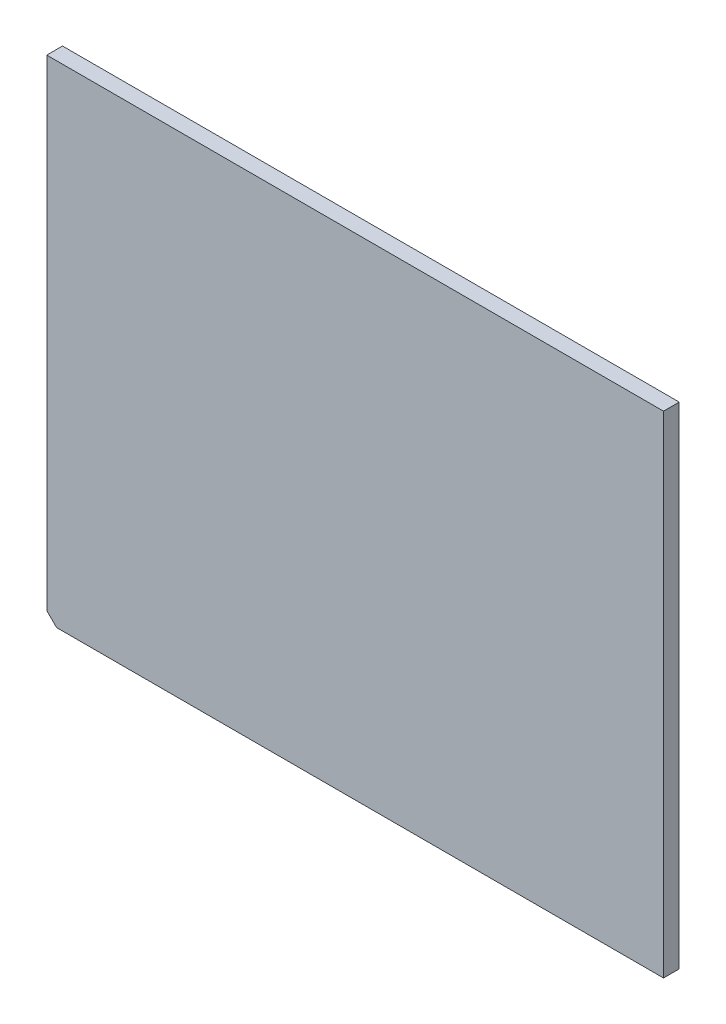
ISO-10303-21;
HEADER;
FILE_DESCRIPTION(('STEP AP214'),'2;1');
FILE_NAME('part.step','',(''),(''),'','','');
FILE_SCHEMA(('AUTOMOTIVE_DESIGN { 1 0 10303 214 1 1 1 1 }'));
ENDSEC;
DATA;
#1=APPLICATION_CONTEXT('core data for automotive mechanical design processes');
#2=APPLICATION_PROTOCOL_DEFINITION('international standard','automotive_design',2000,#1);
#3=PRODUCT_CONTEXT('',#1,'mechanical');
#4=PRODUCT('Part','Part','',(#3));
#5=PRODUCT_RELATED_PRODUCT_CATEGORY('part','',(#4));
#6=PRODUCT_DEFINITION_FORMATION('','',#4);
#7=PRODUCT_DEFINITION_CONTEXT('part definition',#1,'design');
#8=PRODUCT_DEFINITION('design','',#6,#7);
#9=PRODUCT_DEFINITION_SHAPE('','',#8);
#10=(LENGTH_UNIT() NAMED_UNIT(*) SI_UNIT(.MILLI.,.METRE.));
#11=(NAMED_UNIT(*) PLANE_ANGLE_UNIT() SI_UNIT($,.RADIAN.));
#12=(NAMED_UNIT(*) SI_UNIT($,.STERADIAN.) SOLID_ANGLE_UNIT());
#13=UNCERTAINTY_MEASURE_WITH_UNIT(LENGTH_MEASURE(1.E-05),#10,'distance_accuracy_value','');
#14=(GEOMETRIC_REPRESENTATION_CONTEXT(3) GLOBAL_UNCERTAINTY_ASSIGNED_CONTEXT((#13)) GLOBAL_UNIT_ASSIGNED_CONTEXT((#10,
#11,#12)) REPRESENTATION_CONTEXT('',''));
#15=CARTESIAN_POINT('',(0.,0.,0.));
#16=DIRECTION('',(0.,0.,1.));
#17=DIRECTION('',(1.,0.,0.));
#18=AXIS2_PLACEMENT_3D('',#15,#16,#17);
#19=CARTESIAN_POINT('',(-98.,78.,-255.503492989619));
#20=DIRECTION('',(-1.,0.,0.));
#21=DIRECTION('',(0.,-1.,0.));
#22=AXIS2_PLACEMENT_3D('',#19,#20,#21);
#23=PLANE('',#22);
#24=DIRECTION('',(0.,1.,0.));
#25=VECTOR('',#24,1.);
#26=CARTESIAN_POINT('',(-98.,78.,-5.));
#27=LINE('',#26,#25);
#28=CARTESIAN_POINT('',(-98.,-74.8799999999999,-5.));
#29=VERTEX_POINT('',#28);
#30=CARTESIAN_POINT('',(-98.,78.,-5.));
#31=VERTEX_POINT('',#30);
#32=EDGE_CURVE('E108',#29,#31,#27,.T.);
#33=ORIENTED_EDGE('',*,*,#32,.F.);
#34=DIRECTION('',(0.,0.,1.));
#35=VECTOR('',#34,1.);
#36=CARTESIAN_POINT('',(-98.,-74.8799999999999,-255.503492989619));
#37=LINE('',#36,#35);
#38=CARTESIAN_POINT('',(-98.,-74.8799999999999,0.));
#39=VERTEX_POINT('',#38);
#40=EDGE_CURVE('E107',#29,#39,#37,.T.);
#41=ORIENTED_EDGE('',*,*,#40,.T.);
#42=DIRECTION('',(0.,-1.,0.));
#43=VECTOR('',#42,1.);
#44=CARTESIAN_POINT('',(-98.,78.,0.));
#45=LINE('',#44,#43);
#46=CARTESIAN_POINT('',(-98.,78.,0.));
#47=VERTEX_POINT('',#46);
#48=EDGE_CURVE('E85',#47,#39,#45,.T.);
#49=ORIENTED_EDGE('',*,*,#48,.F.);
#50=DIRECTION('',(0.,0.,1.));
#51=VECTOR('',#50,1.);
#52=CARTESIAN_POINT('',(-98.,78.,-255.503492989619));
#53=LINE('',#52,#51);
#54=EDGE_CURVE('E102',#31,#47,#53,.T.);
#55=ORIENTED_EDGE('',*,*,#54,.F.);
#56=EDGE_LOOP('',(#33,#41,#49,#55));
#57=FACE_BOUND('',#56,.T.);
#58=ADVANCED_FACE('F34',(#57),#23,.T.);
#59=CARTESIAN_POINT('',(98.,78.,-255.503492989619));
#60=DIRECTION('',(0.,1.,0.));
#61=DIRECTION('',(-1.,0.,0.));
#62=AXIS2_PLACEMENT_3D('',#59,#60,#61);
#63=PLANE('',#62);
#64=DIRECTION('',(1.,0.,0.));
#65=VECTOR('',#64,1.);
#66=CARTESIAN_POINT('',(98.,78.,-5.));
#67=LINE('',#66,#65);
#68=CARTESIAN_POINT('',(98.,78.,-5.));
#69=VERTEX_POINT('',#68);
#70=EDGE_CURVE('E120',#31,#69,#67,.T.);
#71=ORIENTED_EDGE('',*,*,#70,.F.);
#72=ORIENTED_EDGE('',*,*,#54,.T.);
#73=DIRECTION('',(-1.,0.,0.));
#74=VECTOR('',#73,1.);
#75=CARTESIAN_POINT('',(98.,78.,0.));
#76=LINE('',#75,#74);
#77=CARTESIAN_POINT('',(98.,78.,0.));
#78=VERTEX_POINT('',#77);
#79=EDGE_CURVE('E94',#78,#47,#76,.T.);
#80=ORIENTED_EDGE('',*,*,#79,.F.);
#81=DIRECTION('',(0.,0.,1.));
#82=VECTOR('',#81,1.);
#83=CARTESIAN_POINT('',(98.,78.,-255.503492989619));
#84=LINE('',#83,#82);
#85=EDGE_CURVE('E93',#69,#78,#84,.T.);
#86=ORIENTED_EDGE('',*,*,#85,.F.);
#87=EDGE_LOOP('',(#71,#72,#80,#86));
#88=FACE_BOUND('',#87,.T.);
#89=ADVANCED_FACE('F126',(#88),#63,.T.);
#90=CARTESIAN_POINT('',(98.,-78.,-255.503492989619));
#91=DIRECTION('',(1.,0.,0.));
#92=DIRECTION('',(0.,1.,0.));
#93=AXIS2_PLACEMENT_3D('',#90,#91,#92);
#94=PLANE('',#93);
#95=DIRECTION('',(0.,-1.,0.));
#96=VECTOR('',#95,1.);
#97=CARTESIAN_POINT('',(98.,-78.,-5.));
#98=LINE('',#97,#96);
#99=CARTESIAN_POINT('',(98.,-78.,-5.));
#100=VERTEX_POINT('',#99);
#101=EDGE_CURVE('E104',#69,#100,#98,.T.);
#102=ORIENTED_EDGE('',*,*,#101,.F.);
#103=ORIENTED_EDGE('',*,*,#85,.T.);
#104=DIRECTION('',(0.,1.,0.));
#105=VECTOR('',#104,1.);
#106=CARTESIAN_POINT('',(98.,-78.,0.));
#107=LINE('',#106,#105);
#108=CARTESIAN_POINT('',(98.,-78.,0.));
#109=VERTEX_POINT('',#108);
#110=EDGE_CURVE('E83',#109,#78,#107,.T.);
#111=ORIENTED_EDGE('',*,*,#110,.F.);
#112=DIRECTION('',(0.,0.,1.));
#113=VECTOR('',#112,1.);
#114=CARTESIAN_POINT('',(98.,-78.,-255.503492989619));
#115=LINE('',#114,#113);
#116=EDGE_CURVE('E88',#100,#109,#115,.T.);
#117=ORIENTED_EDGE('',*,*,#116,.F.);
#118=EDGE_LOOP('',(#102,#103,#111,#117));
#119=FACE_BOUND('',#118,.T.);
#120=ADVANCED_FACE('F96',(#119),#94,.T.);
#121=CARTESIAN_POINT('',(-98.,-78.,-255.503492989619));
#122=DIRECTION('',(0.,-1.,0.));
#123=DIRECTION('',(0.,0.,-1.));
#124=AXIS2_PLACEMENT_3D('',#121,#122,#123);
#125=PLANE('',#124);
#126=DIRECTION('',(1.,0.,0.));
#127=VECTOR('',#126,1.);
#128=CARTESIAN_POINT('',(-98.,-78.,0.));
#129=LINE('',#128,#127);
#130=CARTESIAN_POINT('',(-94.8799999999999,-78.,0.));
#131=VERTEX_POINT('',#130);
#132=EDGE_CURVE('E78',#131,#109,#129,.T.);
#133=ORIENTED_EDGE('',*,*,#132,.F.);
#134=DIRECTION('',(0.,0.,-1.));
#135=VECTOR('',#134,1.);
#136=CARTESIAN_POINT('',(-94.8799999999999,-78.,-255.503492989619));
#137=LINE('',#136,#135);
#138=CARTESIAN_POINT('',(-94.8799999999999,-78.,-5.));
#139=VERTEX_POINT('',#138);
#140=EDGE_CURVE('E42',#131,#139,#137,.T.);
#141=ORIENTED_EDGE('',*,*,#140,.T.);
#142=DIRECTION('',(-1.,0.,0.));
#143=VECTOR('',#142,1.);
#144=CARTESIAN_POINT('',(-98.,-78.,-5.));
#145=LINE('',#144,#143);
#146=EDGE_CURVE('E90',#100,#139,#145,.T.);
#147=ORIENTED_EDGE('',*,*,#146,.F.);
#148=ORIENTED_EDGE('',*,*,#116,.T.);
#149=EDGE_LOOP('',(#133,#141,#147,#148));
#150=FACE_BOUND('',#149,.T.);
#151=ADVANCED_FACE('F89',(#150),#125,.T.);
#152=CARTESIAN_POINT('',(0.,0.,0.));
#153=DIRECTION('',(0.,0.,1.));
#154=DIRECTION('',(1.,0.,0.));
#155=AXIS2_PLACEMENT_3D('',#152,#153,#154);
#156=PLANE('',#155);
#157=ORIENTED_EDGE('',*,*,#48,.T.);
#158=DIRECTION('',(-0.707106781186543,0.707106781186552,0.));
#159=VECTOR('',#158,1.);
#160=CARTESIAN_POINT('',(-86.4400000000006,-86.4399999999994,0.));
#161=LINE('',#160,#159);
#162=EDGE_CURVE('E56',#39,#131,#161,.F.);
#163=ORIENTED_EDGE('',*,*,#162,.T.);
#164=ORIENTED_EDGE('',*,*,#132,.T.);
#165=ORIENTED_EDGE('',*,*,#110,.T.);
#166=ORIENTED_EDGE('',*,*,#79,.T.);
#167=EDGE_LOOP('',(#157,#163,#164,#165,#166));
#168=FACE_BOUND('',#167,.T.);
#169=ADVANCED_FACE('F80',(#168),#156,.T.);
#170=CARTESIAN_POINT('',(0.,0.,-5.));
#171=DIRECTION('',(0.,0.,1.));
#172=DIRECTION('',(1.,0.,0.));
#173=AXIS2_PLACEMENT_3D('',#170,#171,#172);
#174=PLANE('',#173);
#175=ORIENTED_EDGE('',*,*,#146,.T.);
#176=DIRECTION('',(0.707106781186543,-0.707106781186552,0.));
#177=VECTOR('',#176,1.);
#178=CARTESIAN_POINT('',(-98.,-74.8799999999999,-5.));
#179=LINE('',#178,#177);
#180=EDGE_CURVE('E11',#139,#29,#179,.F.);
#181=ORIENTED_EDGE('',*,*,#180,.T.);
#182=ORIENTED_EDGE('',*,*,#32,.T.);
#183=ORIENTED_EDGE('',*,*,#70,.T.);
#184=ORIENTED_EDGE('',*,*,#101,.T.);
#185=EDGE_LOOP('',(#175,#181,#182,#183,#184));
#186=FACE_BOUND('',#185,.T.);
#187=ADVANCED_FACE('F123',(#186),#174,.F.);
#188=CARTESIAN_POINT('',(-98.,-74.8799999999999,-255.503492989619));
#189=DIRECTION('',(0.707106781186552,0.707106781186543,0.));
#190=DIRECTION('',(0.,0.,1.));
#191=AXIS2_PLACEMENT_3D('',#188,#189,#190);
#192=PLANE('',#191);
#193=ORIENTED_EDGE('',*,*,#180,.F.);
#194=ORIENTED_EDGE('',*,*,#140,.F.);
#195=ORIENTED_EDGE('',*,*,#162,.F.);
#196=ORIENTED_EDGE('',*,*,#40,.F.);
#197=EDGE_LOOP('',(#193,#194,#195,#196));
#198=FACE_BOUND('',#197,.T.);
#199=ADVANCED_FACE('F36',(#198),#192,.F.);
#200=CLOSED_SHELL('',(#58,#89,#120,#151,#169,#187,#199));
#201=MANIFOLD_SOLID_BREP('B2',#200);
#202=ADVANCED_BREP_SHAPE_REPRESENTATION('',(#18,#201),#14);
#203=SHAPE_DEFINITION_REPRESENTATION(#9,#202);
ENDSEC;
END-ISO-10303-21;
